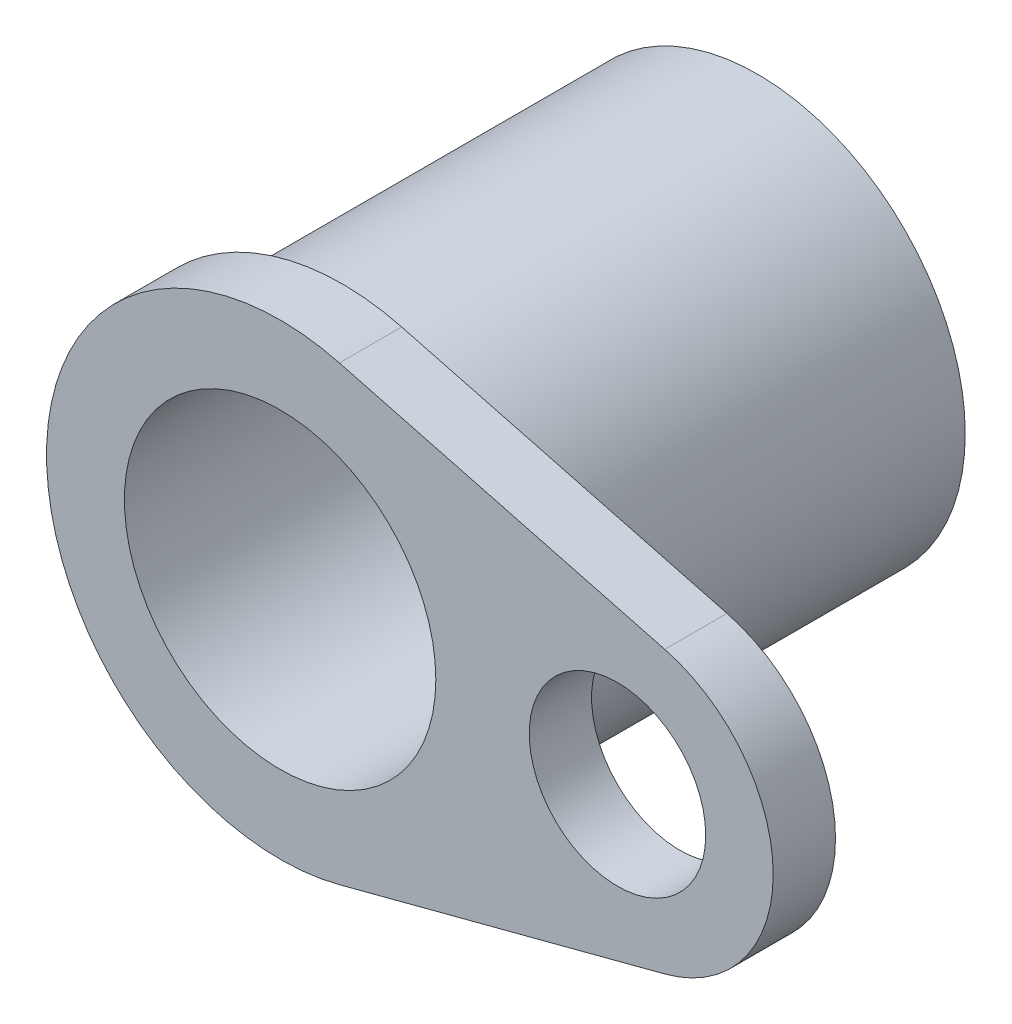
ISO-10303-21;
HEADER;
FILE_DESCRIPTION(('STEP AP214'),'2;1');
FILE_NAME('part.step','',(''),(''),'','','');
FILE_SCHEMA(('AUTOMOTIVE_DESIGN { 1 0 10303 214 1 1 1 1 }'));
ENDSEC;
DATA;
#1=APPLICATION_CONTEXT('core data for automotive mechanical design processes');
#2=APPLICATION_PROTOCOL_DEFINITION('international standard','automotive_design',2000,#1);
#3=PRODUCT_CONTEXT('',#1,'mechanical');
#4=PRODUCT('Part','Part','',(#3));
#5=PRODUCT_RELATED_PRODUCT_CATEGORY('part','',(#4));
#6=PRODUCT_DEFINITION_FORMATION('','',#4);
#7=PRODUCT_DEFINITION_CONTEXT('part definition',#1,'design');
#8=PRODUCT_DEFINITION('design','',#6,#7);
#9=PRODUCT_DEFINITION_SHAPE('','',#8);
#10=(LENGTH_UNIT() NAMED_UNIT(*) SI_UNIT(.MILLI.,.METRE.));
#11=(NAMED_UNIT(*) PLANE_ANGLE_UNIT() SI_UNIT($,.RADIAN.));
#12=(NAMED_UNIT(*) SI_UNIT($,.STERADIAN.) SOLID_ANGLE_UNIT());
#13=UNCERTAINTY_MEASURE_WITH_UNIT(LENGTH_MEASURE(1.E-05),#10,'distance_accuracy_value','');
#14=(GEOMETRIC_REPRESENTATION_CONTEXT(3) GLOBAL_UNCERTAINTY_ASSIGNED_CONTEXT((#13)) GLOBAL_UNIT_ASSIGNED_CONTEXT((#10,
#11,#12)) REPRESENTATION_CONTEXT('',''));
#15=CARTESIAN_POINT('',(0.,0.,0.));
#16=DIRECTION('',(0.,0.,1.));
#17=DIRECTION('',(1.,0.,0.));
#18=AXIS2_PLACEMENT_3D('',#15,#16,#17);
#19=CARTESIAN_POINT('',(0.,0.,0.));
#20=DIRECTION('',(0.,0.,1.));
#21=DIRECTION('',(1.,0.,0.));
#22=AXIS2_PLACEMENT_3D('',#19,#20,#21);
#23=PLANE('',#22);
#24=CARTESIAN_POINT('',(0.,0.,0.));
#25=DIRECTION('',(0.,0.,1.));
#26=DIRECTION('',(1.,0.,0.));
#27=AXIS2_PLACEMENT_3D('',#24,#25,#26);
#28=CIRCLE('',#27,4.);
#29=CARTESIAN_POINT('',(4.,0.,0.));
#30=VERTEX_POINT('',#29);
#31=EDGE_CURVE('E40',#30,#30,#28,.T.);
#32=ORIENTED_EDGE('',*,*,#31,.F.);
#33=EDGE_LOOP('',(#32));
#34=FACE_BOUND('',#33,.T.);
#35=CARTESIAN_POINT('',(0.,0.,0.));
#36=DIRECTION('',(0.,0.,1.));
#37=DIRECTION('',(1.,0.,0.));
#38=AXIS2_PLACEMENT_3D('',#35,#36,#37);
#39=CIRCLE('',#38,3.);
#40=CARTESIAN_POINT('',(3.,0.,0.));
#41=VERTEX_POINT('',#40);
#42=EDGE_CURVE('E123',#41,#41,#39,.T.);
#43=ORIENTED_EDGE('',*,*,#42,.T.);
#44=EDGE_LOOP('',(#43));
#45=FACE_BOUND('',#44,.T.);
#46=ADVANCED_FACE('F36',(#34,#45),#23,.F.);
#47=CARTESIAN_POINT('',(0.,0.,8.));
#48=DIRECTION('',(0.,0.,-1.));
#49=DIRECTION('',(-1.,0.,0.));
#50=AXIS2_PLACEMENT_3D('',#47,#48,#49);
#51=CYLINDRICAL_SURFACE('',#50,4.);
#52=CARTESIAN_POINT('',(0.,0.,8.));
#53=DIRECTION('',(0.,0.,1.));
#54=DIRECTION('',(1.,0.,0.));
#55=AXIS2_PLACEMENT_3D('',#52,#53,#54);
#56=CIRCLE('',#55,4.);
#57=CARTESIAN_POINT('',(4.,0.,8.));
#58=VERTEX_POINT('',#57);
#59=EDGE_CURVE('E11',#58,#58,#56,.T.);
#60=ORIENTED_EDGE('',*,*,#59,.F.);
#61=EDGE_LOOP('',(#60));
#62=FACE_BOUND('',#61,.T.);
#63=ORIENTED_EDGE('',*,*,#31,.T.);
#64=EDGE_LOOP('',(#63));
#65=FACE_BOUND('',#64,.T.);
#66=ADVANCED_FACE('F38',(#62,#65),#51,.T.);
#67=CARTESIAN_POINT('',(0.,0.,8.));
#68=DIRECTION('',(0.,0.,-1.));
#69=DIRECTION('',(-1.,0.,0.));
#70=AXIS2_PLACEMENT_3D('',#67,#68,#69);
#71=CYLINDRICAL_SURFACE('',#70,3.);
#72=ORIENTED_EDGE('',*,*,#42,.F.);
#73=EDGE_LOOP('',(#72));
#74=FACE_BOUND('',#73,.T.);
#75=CARTESIAN_POINT('',(0.,0.,9.2));
#76=DIRECTION('',(0.,0.,1.));
#77=DIRECTION('',(1.,0.,0.));
#78=AXIS2_PLACEMENT_3D('',#75,#76,#77);
#79=CIRCLE('',#78,3.);
#80=CARTESIAN_POINT('',(3.,0.,9.2));
#81=VERTEX_POINT('',#80);
#82=EDGE_CURVE('E106',#81,#81,#79,.F.);
#83=ORIENTED_EDGE('',*,*,#82,.F.);
#84=EDGE_LOOP('',(#83));
#85=FACE_BOUND('',#84,.T.);
#86=ADVANCED_FACE('F135',(#74,#85),#71,.F.);
#87=CARTESIAN_POINT('',(0.,0.,8.));
#88=DIRECTION('',(0.,0.,1.));
#89=DIRECTION('',(1.,0.,0.));
#90=AXIS2_PLACEMENT_3D('',#87,#88,#89);
#91=PLANE('',#90);
#92=CARTESIAN_POINT('',(6.5,0.,8.));
#93=DIRECTION('',(0.,0.,1.));
#94=DIRECTION('',(1.,0.,0.));
#95=AXIS2_PLACEMENT_3D('',#92,#93,#94);
#96=CIRCLE('',#95,1.7);
#97=CARTESIAN_POINT('',(8.2,0.,8.));
#98=VERTEX_POINT('',#97);
#99=EDGE_CURVE('E117',#98,#98,#96,.T.);
#100=ORIENTED_EDGE('',*,*,#99,.T.);
#101=EDGE_LOOP('',(#100));
#102=FACE_BOUND('',#101,.T.);
#103=DIRECTION('',(0.967274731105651,0.253731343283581,0.));
#104=VECTOR('',#103,1.);
#105=CARTESIAN_POINT('',(1.14179104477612,-4.35273628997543,8.));
#106=LINE('',#105,#104);
#107=CARTESIAN_POINT('',(1.14179104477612,-4.35273628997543,8.));
#108=VERTEX_POINT('',#107);
#109=CARTESIAN_POINT('',(7.41044776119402,-2.70836924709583,8.));
#110=VERTEX_POINT('',#109);
#111=EDGE_CURVE('E110',#108,#110,#106,.T.);
#112=ORIENTED_EDGE('',*,*,#111,.F.);
#113=CARTESIAN_POINT('',(0.,0.,8.));
#114=DIRECTION('',(0.,0.,1.));
#115=DIRECTION('',(1.,0.,0.));
#116=AXIS2_PLACEMENT_3D('',#113,#114,#115);
#117=CIRCLE('',#116,4.5);
#118=CARTESIAN_POINT('',(1.14179104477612,4.35273628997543,8.));
#119=VERTEX_POINT('',#118);
#120=EDGE_CURVE('E72',#119,#108,#117,.T.);
#121=ORIENTED_EDGE('',*,*,#120,.F.);
#122=DIRECTION('',(0.967274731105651,-0.253731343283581,0.));
#123=VECTOR('',#122,1.);
#124=CARTESIAN_POINT('',(1.14179104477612,4.35273628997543,8.));
#125=LINE('',#124,#123);
#126=CARTESIAN_POINT('',(7.41044776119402,2.70836924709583,8.));
#127=VERTEX_POINT('',#126);
#128=EDGE_CURVE('E114',#119,#127,#125,.T.);
#129=ORIENTED_EDGE('',*,*,#128,.T.);
#130=CARTESIAN_POINT('',(6.69999999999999,0.,8.));
#131=DIRECTION('',(0.,0.,1.));
#132=DIRECTION('',(1.,0.,0.));
#133=AXIS2_PLACEMENT_3D('',#130,#131,#132);
#134=CIRCLE('',#133,2.80000000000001);
#135=EDGE_CURVE('E92',#110,#127,#134,.T.);
#136=ORIENTED_EDGE('',*,*,#135,.F.);
#137=EDGE_LOOP('',(#112,#121,#129,#136));
#138=FACE_BOUND('',#137,.T.);
#139=ORIENTED_EDGE('',*,*,#59,.T.);
#140=EDGE_LOOP('',(#139));
#141=FACE_BOUND('',#140,.T.);
#142=ADVANCED_FACE('F140',(#102,#138,#141),#91,.F.);
#143=CARTESIAN_POINT('',(1.14179104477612,-4.35273628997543,9.2));
#144=DIRECTION('',(-0.253731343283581,0.967274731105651,0.));
#145=DIRECTION('',(-0.967274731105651,-0.253731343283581,0.));
#146=AXIS2_PLACEMENT_3D('',#143,#144,#145);
#147=PLANE('',#146);
#148=ORIENTED_EDGE('',*,*,#111,.T.);
#149=DIRECTION('',(0.,0.,-1.));
#150=VECTOR('',#149,1.);
#151=CARTESIAN_POINT('',(7.41044776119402,-2.70836924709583,9.2));
#152=LINE('',#151,#150);
#153=CARTESIAN_POINT('',(7.41044776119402,-2.70836924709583,9.2));
#154=VERTEX_POINT('',#153);
#155=EDGE_CURVE('E96',#154,#110,#152,.T.);
#156=ORIENTED_EDGE('',*,*,#155,.F.);
#157=DIRECTION('',(0.967274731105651,0.253731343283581,0.));
#158=VECTOR('',#157,1.);
#159=CARTESIAN_POINT('',(1.14179104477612,-4.35273628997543,9.2));
#160=LINE('',#159,#158);
#161=CARTESIAN_POINT('',(1.14179104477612,-4.35273628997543,9.2));
#162=VERTEX_POINT('',#161);
#163=EDGE_CURVE('E86',#162,#154,#160,.T.);
#164=ORIENTED_EDGE('',*,*,#163,.F.);
#165=DIRECTION('',(0.,0.,-1.));
#166=VECTOR('',#165,1.);
#167=CARTESIAN_POINT('',(1.14179104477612,-4.35273628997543,9.2));
#168=LINE('',#167,#166);
#169=EDGE_CURVE('E109',#162,#108,#168,.T.);
#170=ORIENTED_EDGE('',*,*,#169,.T.);
#171=EDGE_LOOP('',(#148,#156,#164,#170));
#172=FACE_BOUND('',#171,.T.);
#173=ADVANCED_FACE('F142',(#172),#147,.F.);
#174=CARTESIAN_POINT('',(6.69999999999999,0.,9.2));
#175=DIRECTION('',(0.,0.,-1.));
#176=DIRECTION('',(-1.,0.,0.));
#177=AXIS2_PLACEMENT_3D('',#174,#175,#176);
#178=CYLINDRICAL_SURFACE('',#177,2.80000000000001);
#179=ORIENTED_EDGE('',*,*,#135,.T.);
#180=DIRECTION('',(0.,0.,-1.));
#181=VECTOR('',#180,1.);
#182=CARTESIAN_POINT('',(7.41044776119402,2.70836924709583,9.2));
#183=LINE('',#182,#181);
#184=CARTESIAN_POINT('',(7.41044776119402,2.70836924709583,9.2));
#185=VERTEX_POINT('',#184);
#186=EDGE_CURVE('E90',#185,#127,#183,.T.);
#187=ORIENTED_EDGE('',*,*,#186,.F.);
#188=CARTESIAN_POINT('',(6.69999999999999,0.,9.2));
#189=DIRECTION('',(0.,0.,1.));
#190=DIRECTION('',(1.,0.,0.));
#191=AXIS2_PLACEMENT_3D('',#188,#189,#190);
#192=CIRCLE('',#191,2.80000000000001);
#193=EDGE_CURVE('E80',#154,#185,#192,.T.);
#194=ORIENTED_EDGE('',*,*,#193,.F.);
#195=ORIENTED_EDGE('',*,*,#155,.T.);
#196=EDGE_LOOP('',(#179,#187,#194,#195));
#197=FACE_BOUND('',#196,.T.);
#198=ADVANCED_FACE('F91',(#197),#178,.T.);
#199=CARTESIAN_POINT('',(1.14179104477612,4.35273628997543,9.2));
#200=DIRECTION('',(0.253731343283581,0.967274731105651,0.));
#201=DIRECTION('',(-0.967274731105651,0.253731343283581,0.));
#202=AXIS2_PLACEMENT_3D('',#199,#200,#201);
#203=PLANE('',#202);
#204=ORIENTED_EDGE('',*,*,#128,.F.);
#205=DIRECTION('',(0.,0.,-1.));
#206=VECTOR('',#205,1.);
#207=CARTESIAN_POINT('',(1.14179104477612,4.35273628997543,9.2));
#208=LINE('',#207,#206);
#209=CARTESIAN_POINT('',(1.14179104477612,4.35273628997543,9.2));
#210=VERTEX_POINT('',#209);
#211=EDGE_CURVE('E69',#210,#119,#208,.T.);
#212=ORIENTED_EDGE('',*,*,#211,.F.);
#213=DIRECTION('',(0.967274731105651,-0.253731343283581,0.));
#214=VECTOR('',#213,1.);
#215=CARTESIAN_POINT('',(1.14179104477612,4.35273628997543,9.2));
#216=LINE('',#215,#214);
#217=EDGE_CURVE('E84',#210,#185,#216,.T.);
#218=ORIENTED_EDGE('',*,*,#217,.T.);
#219=ORIENTED_EDGE('',*,*,#186,.T.);
#220=EDGE_LOOP('',(#204,#212,#218,#219));
#221=FACE_BOUND('',#220,.T.);
#222=ADVANCED_FACE('F98',(#221),#203,.T.);
#223=CARTESIAN_POINT('',(6.5,0.,9.2));
#224=DIRECTION('',(0.,0.,-1.));
#225=DIRECTION('',(-1.,0.,0.));
#226=AXIS2_PLACEMENT_3D('',#223,#224,#225);
#227=CYLINDRICAL_SURFACE('',#226,1.7);
#228=CARTESIAN_POINT('',(6.5,0.,9.2));
#229=DIRECTION('',(0.,0.,1.));
#230=DIRECTION('',(1.,0.,0.));
#231=AXIS2_PLACEMENT_3D('',#228,#229,#230);
#232=CIRCLE('',#231,1.7);
#233=CARTESIAN_POINT('',(8.2,0.,9.2));
#234=VERTEX_POINT('',#233);
#235=EDGE_CURVE('E100',#234,#234,#232,.T.);
#236=ORIENTED_EDGE('',*,*,#235,.T.);
#237=EDGE_LOOP('',(#236));
#238=FACE_BOUND('',#237,.T.);
#239=ORIENTED_EDGE('',*,*,#99,.F.);
#240=EDGE_LOOP('',(#239));
#241=FACE_BOUND('',#240,.T.);
#242=ADVANCED_FACE('F150',(#238,#241),#227,.F.);
#243=CARTESIAN_POINT('',(0.,0.,9.2));
#244=DIRECTION('',(0.,0.,-1.));
#245=DIRECTION('',(-1.,0.,0.));
#246=AXIS2_PLACEMENT_3D('',#243,#244,#245);
#247=CYLINDRICAL_SURFACE('',#246,4.5);
#248=ORIENTED_EDGE('',*,*,#120,.T.);
#249=ORIENTED_EDGE('',*,*,#169,.F.);
#250=CARTESIAN_POINT('',(0.,0.,9.2));
#251=DIRECTION('',(0.,0.,1.));
#252=DIRECTION('',(1.,0.,0.));
#253=AXIS2_PLACEMENT_3D('',#250,#251,#252);
#254=CIRCLE('',#253,4.5);
#255=EDGE_CURVE('E53',#210,#162,#254,.T.);
#256=ORIENTED_EDGE('',*,*,#255,.F.);
#257=ORIENTED_EDGE('',*,*,#211,.T.);
#258=EDGE_LOOP('',(#248,#249,#256,#257));
#259=FACE_BOUND('',#258,.T.);
#260=ADVANCED_FACE('F151',(#259),#247,.T.);
#261=CARTESIAN_POINT('',(0.,0.,9.2));
#262=DIRECTION('',(0.,0.,1.));
#263=DIRECTION('',(1.,0.,0.));
#264=AXIS2_PLACEMENT_3D('',#261,#262,#263);
#265=PLANE('',#264);
#266=ORIENTED_EDGE('',*,*,#163,.T.);
#267=ORIENTED_EDGE('',*,*,#193,.T.);
#268=ORIENTED_EDGE('',*,*,#217,.F.);
#269=ORIENTED_EDGE('',*,*,#255,.T.);
#270=EDGE_LOOP('',(#266,#267,#268,#269));
#271=FACE_BOUND('',#270,.T.);
#272=ORIENTED_EDGE('',*,*,#235,.F.);
#273=EDGE_LOOP('',(#272));
#274=FACE_BOUND('',#273,.T.);
#275=ORIENTED_EDGE('',*,*,#82,.T.);
#276=EDGE_LOOP('',(#275));
#277=FACE_BOUND('',#276,.T.);
#278=ADVANCED_FACE('F81',(#271,#274,#277),#265,.T.);
#279=CLOSED_SHELL('',(#46,#66,#86,#142,#173,#198,#222,#242,#260,#278));
#280=MANIFOLD_SOLID_BREP('B2',#279);
#281=ADVANCED_BREP_SHAPE_REPRESENTATION('',(#18,#280),#14);
#282=SHAPE_DEFINITION_REPRESENTATION(#9,#281);
ENDSEC;
END-ISO-10303-21;
